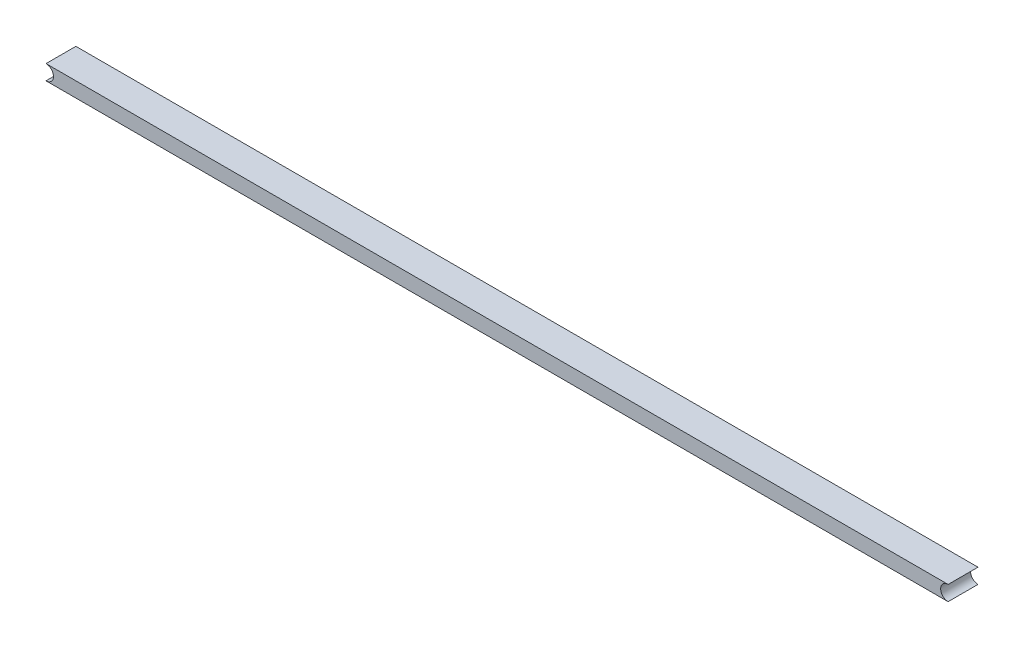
ISO-10303-21;
HEADER;
FILE_DESCRIPTION(('STEP AP214'),'2;1');
FILE_NAME('part.step','',(''),(''),'','','');
FILE_SCHEMA(('AUTOMOTIVE_DESIGN { 1 0 10303 214 1 1 1 1 }'));
ENDSEC;
DATA;
#1=APPLICATION_CONTEXT('core data for automotive mechanical design processes');
#2=APPLICATION_PROTOCOL_DEFINITION('international standard','automotive_design',2000,#1);
#3=PRODUCT_CONTEXT('',#1,'mechanical');
#4=PRODUCT('Part','Part','',(#3));
#5=PRODUCT_RELATED_PRODUCT_CATEGORY('part','',(#4));
#6=PRODUCT_DEFINITION_FORMATION('','',#4);
#7=PRODUCT_DEFINITION_CONTEXT('part definition',#1,'design');
#8=PRODUCT_DEFINITION('design','',#6,#7);
#9=PRODUCT_DEFINITION_SHAPE('','',#8);
#10=(LENGTH_UNIT() NAMED_UNIT(*) SI_UNIT(.MILLI.,.METRE.));
#11=(NAMED_UNIT(*) PLANE_ANGLE_UNIT() SI_UNIT($,.RADIAN.));
#12=(NAMED_UNIT(*) SI_UNIT($,.STERADIAN.) SOLID_ANGLE_UNIT());
#13=UNCERTAINTY_MEASURE_WITH_UNIT(LENGTH_MEASURE(1.E-05),#10,'distance_accuracy_value','');
#14=(GEOMETRIC_REPRESENTATION_CONTEXT(3) GLOBAL_UNCERTAINTY_ASSIGNED_CONTEXT((#13)) GLOBAL_UNIT_ASSIGNED_CONTEXT((#10,
#11,#12)) REPRESENTATION_CONTEXT('',''));
#15=CARTESIAN_POINT('',(0.,0.,0.));
#16=DIRECTION('',(0.,0.,1.));
#17=DIRECTION('',(1.,0.,0.));
#18=AXIS2_PLACEMENT_3D('',#15,#16,#17);
#19=CARTESIAN_POINT('',(302.,0.,10.));
#20=DIRECTION('',(0.,0.,-1.));
#21=DIRECTION('',(-1.,0.,0.));
#22=AXIS2_PLACEMENT_3D('',#19,#20,#21);
#23=PLANE('',#22);
#24=DIRECTION('',(-1.,0.,0.));
#25=VECTOR('',#24,1.);
#26=CARTESIAN_POINT('',(302.,-10.,10.));
#27=LINE('',#26,#25);
#28=CARTESIAN_POINT('',(302.,-10.,10.));
#29=VERTEX_POINT('',#28);
#30=CARTESIAN_POINT('',(-302.,-9.99999999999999,10.));
#31=VERTEX_POINT('',#30);
#32=EDGE_CURVE('E11',#29,#31,#27,.T.);
#33=ORIENTED_EDGE('',*,*,#32,.F.);
#34=CARTESIAN_POINT('',(302.,-5.,10.));
#35=DIRECTION('',(0.,0.,1.));
#36=DIRECTION('',(1.,0.,0.));
#37=AXIS2_PLACEMENT_3D('',#34,#35,#36);
#38=CIRCLE('',#37,4.99999999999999);
#39=CARTESIAN_POINT('',(302.,0.,10.));
#40=VERTEX_POINT('',#39);
#41=EDGE_CURVE('E42',#40,#29,#38,.T.);
#42=ORIENTED_EDGE('',*,*,#41,.F.);
#43=DIRECTION('',(-1.,0.,0.));
#44=VECTOR('',#43,1.);
#45=CARTESIAN_POINT('',(302.,0.,10.));
#46=LINE('',#45,#44);
#47=CARTESIAN_POINT('',(-302.,0.,10.));
#48=VERTEX_POINT('',#47);
#49=EDGE_CURVE('E74',#40,#48,#46,.T.);
#50=ORIENTED_EDGE('',*,*,#49,.T.);
#51=CARTESIAN_POINT('',(-302.,-5.,10.));
#52=DIRECTION('',(0.,0.,1.));
#53=DIRECTION('',(1.,0.,0.));
#54=AXIS2_PLACEMENT_3D('',#51,#52,#53);
#55=CIRCLE('',#54,4.99999999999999);
#56=EDGE_CURVE('E98',#31,#48,#55,.T.);
#57=ORIENTED_EDGE('',*,*,#56,.F.);
#58=EDGE_LOOP('',(#33,#42,#50,#57));
#59=FACE_BOUND('',#58,.T.);
#60=ADVANCED_FACE('F28',(#59),#23,.F.);
#61=CARTESIAN_POINT('',(302.,-10.,10.));
#62=DIRECTION('',(0.,1.,0.));
#63=DIRECTION('',(0.,0.,1.));
#64=AXIS2_PLACEMENT_3D('',#61,#62,#63);
#65=PLANE('',#64);
#66=DIRECTION('',(0.,0.,-1.));
#67=VECTOR('',#66,1.);
#68=CARTESIAN_POINT('',(-302.,-10.,10.));
#69=LINE('',#68,#67);
#70=CARTESIAN_POINT('',(-302.,-10.,-10.));
#71=VERTEX_POINT('',#70);
#72=EDGE_CURVE('E95',#31,#71,#69,.T.);
#73=ORIENTED_EDGE('',*,*,#72,.T.);
#74=DIRECTION('',(-1.,0.,0.));
#75=VECTOR('',#74,1.);
#76=CARTESIAN_POINT('',(302.,-10.,-10.));
#77=LINE('',#76,#75);
#78=CARTESIAN_POINT('',(302.,-9.99999999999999,-10.));
#79=VERTEX_POINT('',#78);
#80=EDGE_CURVE('E35',#79,#71,#77,.T.);
#81=ORIENTED_EDGE('',*,*,#80,.F.);
#82=DIRECTION('',(0.,0.,-1.));
#83=VECTOR('',#82,1.);
#84=CARTESIAN_POINT('',(302.,-10.,10.));
#85=LINE('',#84,#83);
#86=EDGE_CURVE('E75',#29,#79,#85,.T.);
#87=ORIENTED_EDGE('',*,*,#86,.F.);
#88=ORIENTED_EDGE('',*,*,#32,.T.);
#89=EDGE_LOOP('',(#73,#81,#87,#88));
#90=FACE_BOUND('',#89,.T.);
#91=ADVANCED_FACE('F94',(#90),#65,.F.);
#92=CARTESIAN_POINT('',(302.,0.,-10.));
#93=DIRECTION('',(0.,0.,1.));
#94=DIRECTION('',(0.,-1.,0.));
#95=AXIS2_PLACEMENT_3D('',#92,#93,#94);
#96=PLANE('',#95);
#97=DIRECTION('',(-1.,0.,0.));
#98=VECTOR('',#97,1.);
#99=CARTESIAN_POINT('',(302.,0.,-10.));
#100=LINE('',#99,#98);
#101=CARTESIAN_POINT('',(302.,0.,-10.));
#102=VERTEX_POINT('',#101);
#103=CARTESIAN_POINT('',(-302.,0.,-10.));
#104=VERTEX_POINT('',#103);
#105=EDGE_CURVE('E85',#102,#104,#100,.T.);
#106=ORIENTED_EDGE('',*,*,#105,.F.);
#107=CARTESIAN_POINT('',(302.,-5.,-10.));
#108=DIRECTION('',(0.,0.,1.));
#109=DIRECTION('',(1.,0.,0.));
#110=AXIS2_PLACEMENT_3D('',#107,#108,#109);
#111=CIRCLE('',#110,4.99999999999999);
#112=EDGE_CURVE('E69',#102,#79,#111,.T.);
#113=ORIENTED_EDGE('',*,*,#112,.T.);
#114=ORIENTED_EDGE('',*,*,#80,.T.);
#115=CARTESIAN_POINT('',(-302.,-5.,-10.));
#116=DIRECTION('',(0.,0.,1.));
#117=DIRECTION('',(1.,0.,0.));
#118=AXIS2_PLACEMENT_3D('',#115,#116,#117);
#119=CIRCLE('',#118,4.99999999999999);
#120=EDGE_CURVE('E50',#71,#104,#119,.T.);
#121=ORIENTED_EDGE('',*,*,#120,.T.);
#122=EDGE_LOOP('',(#106,#113,#114,#121));
#123=FACE_BOUND('',#122,.T.);
#124=ADVANCED_FACE('F92',(#123),#96,.F.);
#125=CARTESIAN_POINT('',(302.,0.,10.));
#126=DIRECTION('',(0.,-1.,0.));
#127=DIRECTION('',(0.,0.,-1.));
#128=AXIS2_PLACEMENT_3D('',#125,#126,#127);
#129=PLANE('',#128);
#130=DIRECTION('',(0.,0.,1.));
#131=VECTOR('',#130,1.);
#132=CARTESIAN_POINT('',(-302.,0.,10.));
#133=LINE('',#132,#131);
#134=EDGE_CURVE('E84',#104,#48,#133,.T.);
#135=ORIENTED_EDGE('',*,*,#134,.T.);
#136=ORIENTED_EDGE('',*,*,#49,.F.);
#137=DIRECTION('',(0.,0.,1.));
#138=VECTOR('',#137,1.);
#139=CARTESIAN_POINT('',(302.,0.,10.));
#140=LINE('',#139,#138);
#141=EDGE_CURVE('E66',#102,#40,#140,.T.);
#142=ORIENTED_EDGE('',*,*,#141,.F.);
#143=ORIENTED_EDGE('',*,*,#105,.T.);
#144=EDGE_LOOP('',(#135,#136,#142,#143));
#145=FACE_BOUND('',#144,.T.);
#146=ADVANCED_FACE('F83',(#145),#129,.F.);
#147=CARTESIAN_POINT('',(-302.,-5.,-10.));
#148=DIRECTION('',(0.,0.,1.));
#149=DIRECTION('',(1.,0.,0.));
#150=AXIS2_PLACEMENT_3D('',#147,#148,#149);
#151=CYLINDRICAL_SURFACE('',#150,4.99999999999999);
#152=ORIENTED_EDGE('',*,*,#120,.F.);
#153=ORIENTED_EDGE('',*,*,#72,.F.);
#154=ORIENTED_EDGE('',*,*,#56,.T.);
#155=ORIENTED_EDGE('',*,*,#134,.F.);
#156=EDGE_LOOP('',(#152,#153,#154,#155));
#157=FACE_BOUND('',#156,.T.);
#158=ADVANCED_FACE('F102',(#157),#151,.F.);
#159=CARTESIAN_POINT('',(302.,-5.,-10.));
#160=DIRECTION('',(0.,0.,1.));
#161=DIRECTION('',(1.,0.,0.));
#162=AXIS2_PLACEMENT_3D('',#159,#160,#161);
#163=CYLINDRICAL_SURFACE('',#162,4.99999999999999);
#164=ORIENTED_EDGE('',*,*,#141,.T.);
#165=ORIENTED_EDGE('',*,*,#41,.T.);
#166=ORIENTED_EDGE('',*,*,#86,.T.);
#167=ORIENTED_EDGE('',*,*,#112,.F.);
#168=EDGE_LOOP('',(#164,#165,#166,#167));
#169=FACE_BOUND('',#168,.T.);
#170=ADVANCED_FACE('F67',(#169),#163,.F.);
#171=CLOSED_SHELL('',(#60,#91,#124,#146,#158,#170));
#172=MANIFOLD_SOLID_BREP('B2',#171);
#173=ADVANCED_BREP_SHAPE_REPRESENTATION('',(#18,#172),#14);
#174=SHAPE_DEFINITION_REPRESENTATION(#9,#173);
ENDSEC;
END-ISO-10303-21;
